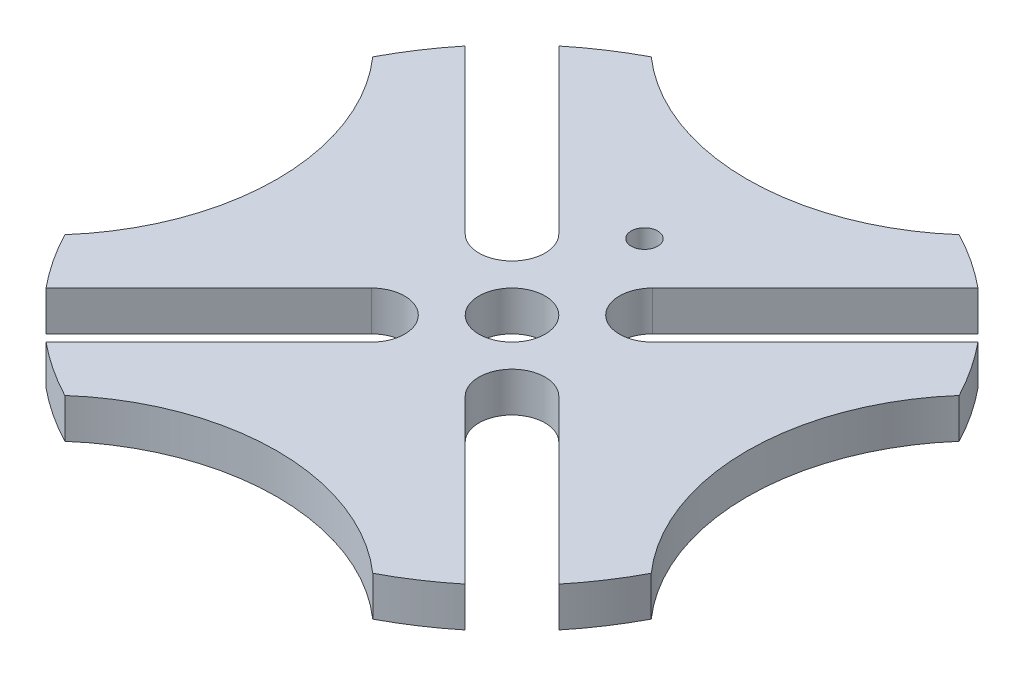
from build123d import *

# Parameters (mm, degrees)
SKETCH_1_R               = 50
EXTRUDE_1_DEPTH          = 6
CUT_EXTRUDE_1_DEPTH      = 71.964779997
SKETCH_3_R               = 35.2
CUT_EXTRUDE_2_DEPTH      = 71.964779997
PATTERN_CIRCULAR_1_COUNT = 4
SKETCH_4_R               = 5
CUT_EXTRUDE_3_DEPTH      = 63.89081845
SKETCH_5_R               = 2
CUT_EXTRUDE_4_DEPTH      = 63.89081845


with BuildPart() as part:
    # Sketch 1 → Extrude 1 (new body)
    with BuildSketch(Plane(origin=(0, 0, 0), x_dir=(1, 0, 0), z_dir=(0, 1, 0))):
        with Locations(Location((0, 0, 0), (0, 0, 270))):
            Circle(SKETCH_1_R)
    extrude(amount=EXTRUDE_1_DEPTH)

    # Sketch 2 → Cut-Extrude 1 (cut, through all)
    with BuildSketch(Plane(origin=(0, 6, 0), x_dir=(1, 0, 0), z_dir=(0, 1, 0))):
        with BuildLine():
            Line((-7.071067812, 14.142135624), (-31.642584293, 38.713652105))
            ThreePointArc((-31.642584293, 38.713652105), (-35.355339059, 35.355339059), (-38.713652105, 31.642584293))
            Line((-38.713652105, 31.642584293), (-14.142135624, 7.071067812))
            ThreePointArc((-14.142135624, 7.071067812), (-7.071067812, 7.071067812), (-7.071067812, 14.142135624))
        make_face()
    cut_extrude_1 = extrude(amount=-CUT_EXTRUDE_1_DEPTH, mode=Mode.SUBTRACT)

    # Sketch 3 → Cut-Extrude 2 (cut, through all)
    with BuildSketch(Plane(origin=(0, 6, 0), x_dir=(1, 0, 0), z_dir=(0, 1, 0))):
        with Locations((-70.7, 0)):
            Circle(SKETCH_3_R)
    cut_extrude_2 = extrude(amount=-CUT_EXTRUDE_2_DEPTH, mode=Mode.SUBTRACT)

    # Pattern Circular 1: Cut-Extrude 1, Cut-Extrude 2 ×4 about axis
    pattern_circular_1_axis = Axis((0, 0, 0), (0, 1, 0))
    add([cut_extrude_1.rotate(pattern_circular_1_axis, i * 360 / PATTERN_CIRCULAR_1_COUNT) for i in range(1, PATTERN_CIRCULAR_1_COUNT)], mode=Mode.SUBTRACT)
    add([cut_extrude_2.rotate(pattern_circular_1_axis, i * 360 / PATTERN_CIRCULAR_1_COUNT) for i in range(1, PATTERN_CIRCULAR_1_COUNT)], mode=Mode.SUBTRACT)

    # Sketch 4 → Cut-Extrude 3 (cut, through all)
    with BuildSketch(Plane(origin=(0, 6, 0), x_dir=(1, 0, 0), z_dir=(0, 1, 0))):
        with Locations(Location((0, 0, 0), (0, 0, 270))):
            Circle(SKETCH_4_R)
    extrude(amount=-CUT_EXTRUDE_3_DEPTH, mode=Mode.SUBTRACT)

    # Sketch 5 → Cut-Extrude 4 (cut, through all)
    with BuildSketch(Plane(origin=(0, 6, 0), x_dir=(1, 0, 0), z_dir=(0, 1, 0))):
        with Locations(Location((0, 20, 0), (0, 0, 270))):
            Circle(SKETCH_5_R)
    extrude(amount=-CUT_EXTRUDE_4_DEPTH, mode=Mode.SUBTRACT)


solid = part.part
